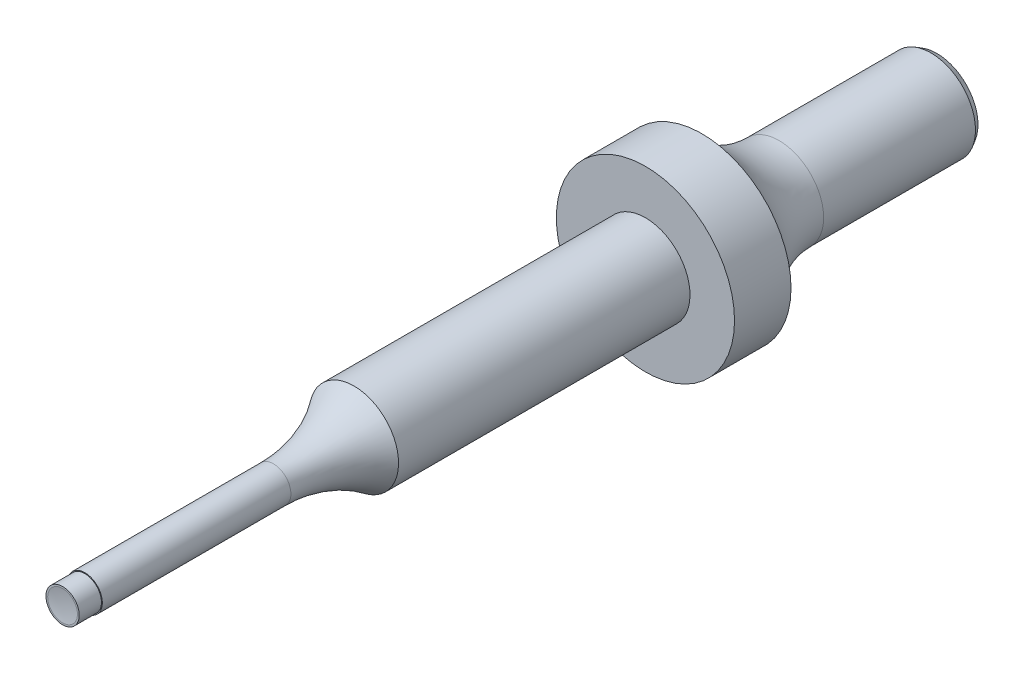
from build123d import *

# Parameters (mm, degrees)
SKETCH1_R           = 5.095
BOSS_EXTRUDE1_DEPTH = 100
SKETCH2_OUTSIDE_W   = 32.396
SKETCH2_OUTSIDE_H   = 32.396
SKETCH2_OUTSIDE_R   = 2
CUT_EXTRUDE1_DEPTH  = 33.333333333
SKETCH3_OUTSIDE_W   = 32.396
SKETCH3_OUTSIDE_H   = 32.396
SKETCH3_OUTSIDE_R   = 1.9
CUT_EXTRUDE2_DEPTH  = 2.5475
CHAMFER1_SIZE       = 0.679333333
CHAMFER1_SIZE2      = 0.392213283


with BuildPart() as part:
    # Sketch1 → Boss-Extrude1 (new body)
    with BuildSketch(Plane.XY):
        Circle(SKETCH1_R)
    extrude(amount=-BOSS_EXTRUDE1_DEPTH)

    # Sketch2 outside → Cut-Extrude1 (cut)
    with BuildSketch(Plane.XY):
        Rectangle(SKETCH2_OUTSIDE_W, SKETCH2_OUTSIDE_H)
        Circle(SKETCH2_OUTSIDE_R, mode=Mode.SUBTRACT)
    extrude(amount=-CUT_EXTRUDE1_DEPTH, mode=Mode.SUBTRACT)

    # Sketch3 outside → Cut-Extrude2 (cut)
    with BuildSketch(Plane.XY):
        Rectangle(SKETCH3_OUTSIDE_W, SKETCH3_OUTSIDE_H)
        Circle(SKETCH3_OUTSIDE_R, mode=Mode.SUBTRACT)
    extrude(amount=-CUT_EXTRUDE2_DEPTH, mode=Mode.SUBTRACT)

    # Sketch4 → Cut-Revolve1 (revolve, cut)
    with BuildSketch(Plane(origin=(0, 0, 0), x_dir=(0, 0, -1), z_dir=(1, 0, 0)), mode=Mode.PRIVATE) as cut_revolve1_sk:
        with BuildLine():
            Line((0, 0), (0, 1.7))
            ThreePointArc((0, 1.7), (0.10704201, 0.852993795), (0.142806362, 0))
            Line((0.142806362, 0), (0, 0))
        make_face()
    revolve(cut_revolve1_sk.sketch.rotate(Axis((0, 0, 0), (0, 0, -1)), 180), axis=Axis((0, 0, 0), (0, 0, -1)), mode=Mode.SUBTRACT)

    # Chamfer1
    chamfer1_edges = [part.edges().sort_by_distance(p)[0] for p in [
        (-5.095, 0, -100),
    ]]
    chamfer1_side = [part.faces().sort_by_distance(p)[0] for p in [
        (-5.095, 0, -66.666666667),
    ]]
    chamfer(chamfer1_edges, length=CHAMFER1_SIZE, length2=CHAMFER1_SIZE2, reference=chamfer1_side[0])

    # Sketch5 → Revolve1 (revolve)
    with BuildSketch(Plane(origin=(0, 0, 0), x_dir=(0, 0, -1), z_dir=(1, 0, 0)), mode=Mode.PRIVATE) as revolve1_sk:
        with BuildLine():
            Line((33.333333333, 0), (24.111884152, 0))
            Line((24.111884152, 0), (24.111884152, 2))
            ThreePointArc((24.111884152, 2), (28.975374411, 2.794393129), (33.333333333, 5.095))
            Line((33.333333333, 5.095), (33.333333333, 0))
        make_face()
    revolve(revolve1_sk.sketch.rotate(Axis((0, 0, -33.333333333), (0, 0, 1)), 270), axis=Axis((0, 0, -33.333333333), (0, 0, 1)))

    # Sketch6 → Revolve2 (revolve)
    with BuildSketch(Plane(origin=(0, 0, 0), x_dir=(0, 0, -1), z_dir=(1, 0, 0)), mode=Mode.PRIVATE) as revolve2_sk:
        with BuildLine():
            Line((66.666666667, 0), (81.951666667, 0))
            Line((81.951666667, 0), (81.951666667, 5.095))
            ThreePointArc((81.951666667, 5.095), (76.856666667, 6.460201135), (73.126867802, 10.19))
            Line((73.126867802, 10.19), (66.666666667, 10.19))
            Line((66.666666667, 10.19), (66.666666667, 0))
        make_face()
    revolve(revolve2_sk.sketch.rotate(Axis((0, 0, -66.666666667), (0, 0, -1)), 90), axis=Axis((0, 0, -66.666666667), (0, 0, -1)))


solid = part.part
